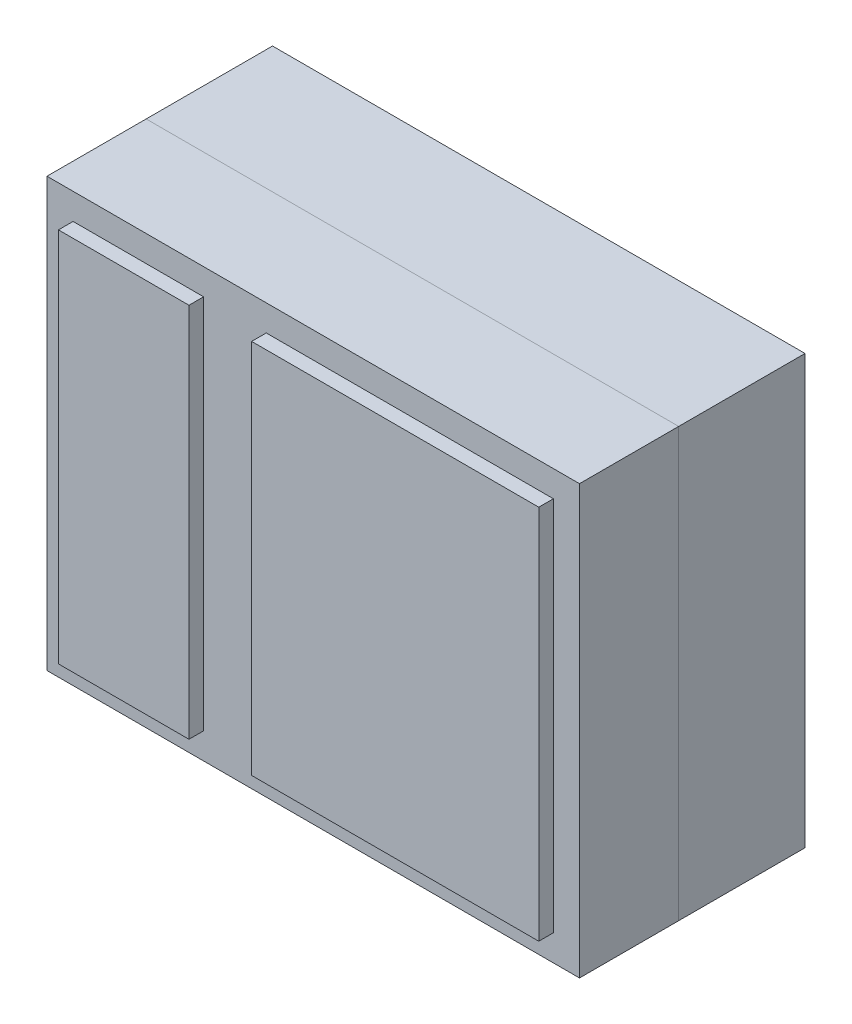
from build123d import *

# Parameters (mm, degrees)
SKETCH_1_W        = 2.04
SKETCH_1_H        = 1.64
EXTRUDE_1_DEPTH   = 0.484
EXTRUDE_START     = -0.484
EXTRUDE_2_DEPTH   = 0.056
EXTRUDE_2_2_DEPTH = 0.056
EXTRUDE_START_2   = -0.428
SKETCH_4_W        = 0.89
SKETCH_4_H        = 0.89
EXTRUDE_3_DEPTH   = 0.15
SKETCH_5_W        = 0.22
SKETCH_5_H        = 0.42
EXTRUDE_4_DEPTH   = 0.1
SKETCH_7_W        = 2.04
SKETCH_7_H        = 1.64
EXTRUDE_5_DEPTH   = 0.38
EXTRUDE_START_3   = 0.38
SKETCH_6_W        = 0.5
SKETCH_6_H        = 1.44
EXTRUDE_6_DEPTH   = 0.056
SKETCH_6_W_2      = 1.1
EXTRUDE_6_2_DEPTH = 0.056


with BuildPart() as part:
    # Sketch 1 → Extrude 1 (new body)
    with BuildSketch(Plane.XY):
        with Locations((0.3, 0)):
            Rectangle(SKETCH_1_W, SKETCH_1_H)
    extrude(amount=EXTRUDE_1_DEPTH)


with BuildPart() as body_2:
    # Sketch 3 → Extrude 2 (new body)
    with BuildSketch(Plane(origin=(0, 0, 0), x_dir=(-1, 0, 0), z_dir=(0, 0, -1)).offset(EXTRUDE_START)):
        Polygon((0.62, -0.04), (-1.11, -0.04), (-1.11, -0.62), (-0.850492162, -0.62), (-0.850492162, -0.72), (0.52, -0.72), (0.52, -0.62), (0.62, -0.62), align=None)
    extrude(amount=EXTRUDE_2_DEPTH)


with BuildPart() as body_3:
    # Sketch 3 → Extrude 2 2 (new body)
    with BuildSketch(Plane(origin=(0, 0, 0), x_dir=(-1, 0, 0), z_dir=(0, 0, -1)).offset(EXTRUDE_START)):
        Polygon((0.62, 0.04), (-1.11, 0.04), (-1.11, 0.62), (-0.86, 0.62), (-0.86, 0.25), (-0.78, 0.25), (-0.78, 0.72), (0.52, 0.72), (0.52, 0.62), (0.62, 0.62), align=None)
    extrude(amount=EXTRUDE_2_2_DEPTH)


with BuildPart() as body_4:
    # Sketch 4 → Extrude 3 (new body)
    with BuildSketch(Plane(origin=(0, 0, 0), x_dir=(-1, 0, 0), z_dir=(0, 0, -1)).offset(EXTRUDE_START_2)):
        Rectangle(SKETCH_4_W, SKETCH_4_H)
    extrude(amount=EXTRUDE_3_DEPTH)


with BuildPart() as body_5:
    # Sketch 5 → Extrude 4 (new body)
    with BuildSketch(Plane(origin=(0, 0, 0.428), x_dir=(-1, 0, 0), z_dir=(0, 0, -1))):
        with Locations((-0.822741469, 0)):
            Rectangle(SKETCH_5_W, SKETCH_5_H)
    extrude(amount=EXTRUDE_4_DEPTH)


with BuildPart() as body_6:
    # Sketch 7 → Extrude 5 (new body)
    with BuildSketch(Plane.XY.offset(0.484)):
        with Locations((0.3, 0)):
            Rectangle(SKETCH_7_W, SKETCH_7_H)
    extrude(amount=EXTRUDE_5_DEPTH)


with BuildPart() as body_7:
    # Sketch 6 → Extrude 6 (new body)
    with BuildSketch(Plane.XY.offset(0.484).offset(EXTRUDE_START_3)):
        with Locations((-0.37, 0)):
            Rectangle(SKETCH_6_W, SKETCH_6_H)
    extrude(amount=EXTRUDE_6_DEPTH)


with BuildPart() as body_8:
    # Sketch 6 → Extrude 6 2 (new body)
    with BuildSketch(Plane.XY.offset(0.484).offset(EXTRUDE_START_3)):
        with Locations((0.67, 0)):
            Rectangle(SKETCH_6_W_2, SKETCH_6_H)
    extrude(amount=EXTRUDE_6_2_DEPTH)


solid = Compound([part.part, body_2.part, body_3.part, body_4.part, body_5.part, body_6.part, body_7.part, body_8.part])
